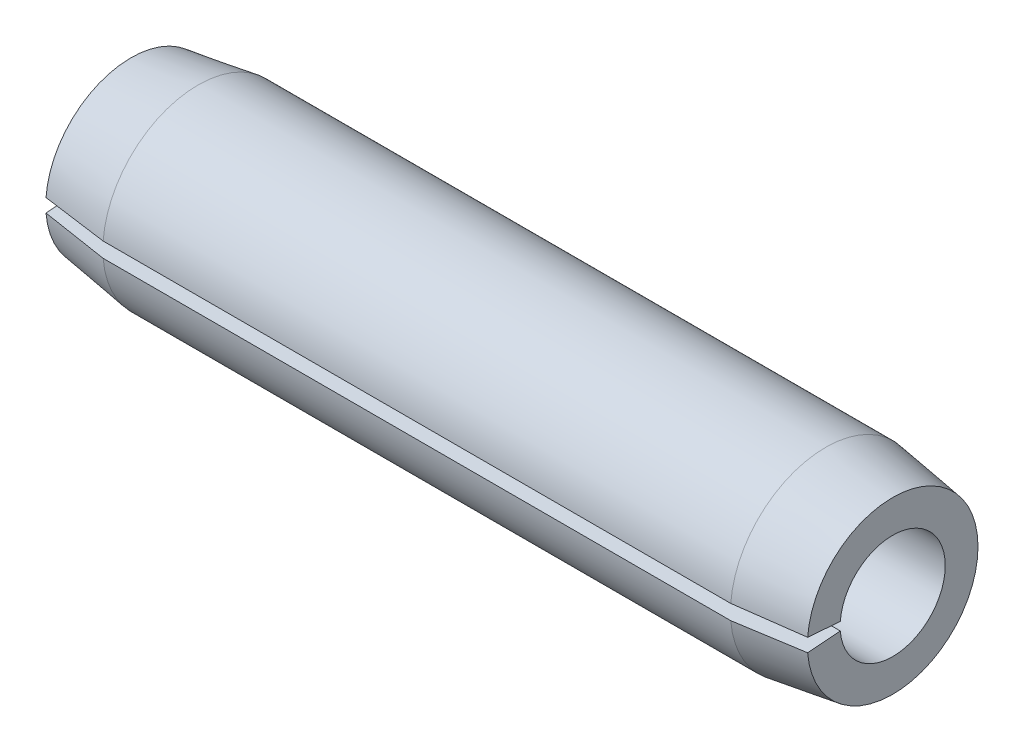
from build123d import *

# Parameters (mm, degrees)
GAP_DEPTH = 13.896910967


with BuildPart() as part:
    # Sketch1 → Base-Revolve (revolve)
    with BuildSketch(Plane.XY, mode=Mode.PRIVATE) as base_revolve_sk:
        Polygon((0, 0.8763), (12.7, 0.8763), (12.7, 1.4224), (11.5824, 1.5875), (1.1176, 1.5875), (0, 1.4224), align=None)
    revolve(base_revolve_sk.sketch.rotate(Axis((-9.525, 0, 0), (1, 0, 0)), 90), axis=Axis((-9.525, 0, 0), (1, 0, 0)))

    # Sketch2 → Gap (cut, through all)
    with BuildSketch(Plane(origin=(0, 0, 0), x_dir=(0, -1, 0), z_dir=(-1, 0, 0))):
        with BuildLine():
            Line((0, 0), (0.127044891, 1.614258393))
            ThreePointArc((0.127044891, 1.614258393), (0, 1.61925), (-0.127044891, 1.614258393))
            Line((-0.127044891, 1.614258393), (0, 0))
        make_face()
    extrude(amount=-GAP_DEPTH, mode=Mode.SUBTRACT)


solid = part.part
